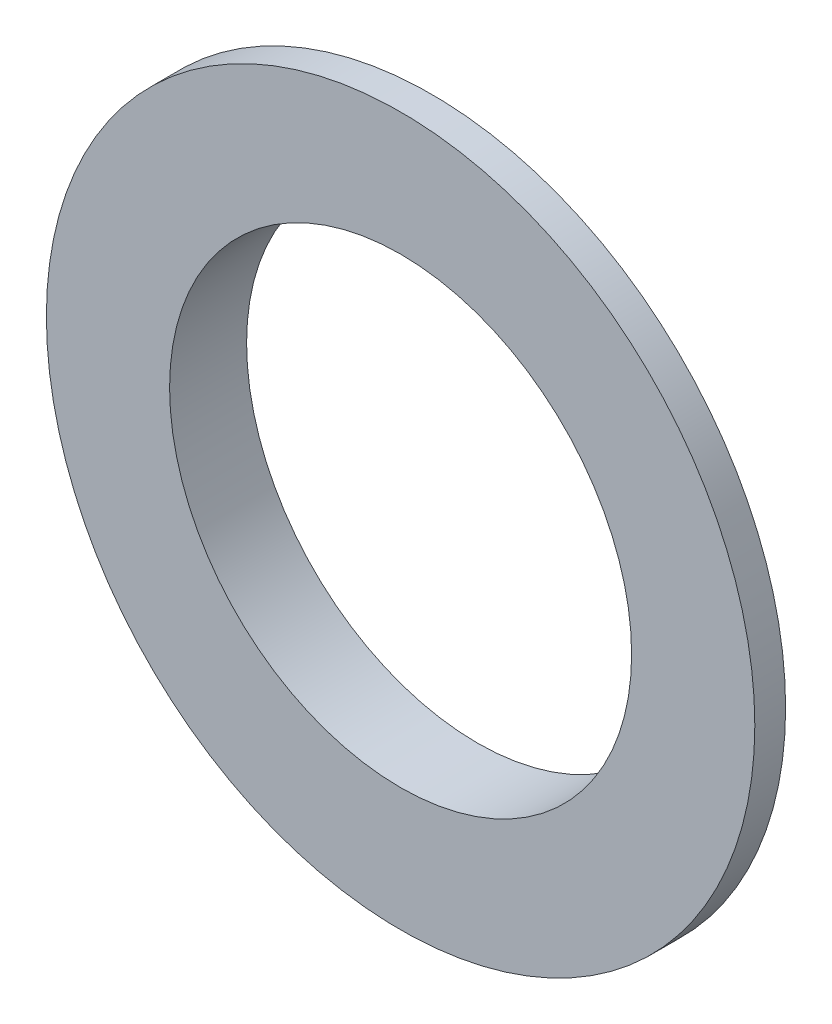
ISO-10303-21;
HEADER;
FILE_DESCRIPTION(('STEP AP214'),'2;1');
FILE_NAME('part.step','',(''),(''),'','','');
FILE_SCHEMA(('AUTOMOTIVE_DESIGN { 1 0 10303 214 1 1 1 1 }'));
ENDSEC;
DATA;
#1=APPLICATION_CONTEXT('core data for automotive mechanical design processes');
#2=APPLICATION_PROTOCOL_DEFINITION('international standard','automotive_design',2000,#1);
#3=PRODUCT_CONTEXT('',#1,'mechanical');
#4=PRODUCT('Part','Part','',(#3));
#5=PRODUCT_RELATED_PRODUCT_CATEGORY('part','',(#4));
#6=PRODUCT_DEFINITION_FORMATION('','',#4);
#7=PRODUCT_DEFINITION_CONTEXT('part definition',#1,'design');
#8=PRODUCT_DEFINITION('design','',#6,#7);
#9=PRODUCT_DEFINITION_SHAPE('','',#8);
#10=(LENGTH_UNIT() NAMED_UNIT(*) SI_UNIT(.MILLI.,.METRE.));
#11=(NAMED_UNIT(*) PLANE_ANGLE_UNIT() SI_UNIT($,.RADIAN.));
#12=(NAMED_UNIT(*) SI_UNIT($,.STERADIAN.) SOLID_ANGLE_UNIT());
#13=UNCERTAINTY_MEASURE_WITH_UNIT(LENGTH_MEASURE(1.E-05),#10,'distance_accuracy_value','');
#14=(GEOMETRIC_REPRESENTATION_CONTEXT(3) GLOBAL_UNCERTAINTY_ASSIGNED_CONTEXT((#13)) GLOBAL_UNIT_ASSIGNED_CONTEXT((#10,
#11,#12)) REPRESENTATION_CONTEXT('',''));
#15=CARTESIAN_POINT('',(0.,0.,0.));
#16=DIRECTION('',(0.,0.,1.));
#17=DIRECTION('',(1.,0.,0.));
#18=AXIS2_PLACEMENT_3D('',#15,#16,#17);
#19=CARTESIAN_POINT('',(0.,0.,0.));
#20=DIRECTION('',(0.,0.,-1.));
#21=DIRECTION('',(-1.,0.,0.));
#22=AXIS2_PLACEMENT_3D('',#19,#20,#21);
#23=PLANE('',#22);
#24=CARTESIAN_POINT('',(0.,0.,0.));
#25=DIRECTION('',(0.,0.,1.));
#26=DIRECTION('',(1.,0.,0.));
#27=AXIS2_PLACEMENT_3D('',#24,#25,#26);
#28=CIRCLE('',#27,7.5);
#29=CARTESIAN_POINT('',(7.5,0.,0.));
#30=VERTEX_POINT('',#29);
#31=EDGE_CURVE('E49',#30,#30,#28,.T.);
#32=ORIENTED_EDGE('',*,*,#31,.T.);
#33=EDGE_LOOP('',(#32));
#34=FACE_BOUND('',#33,.T.);
#35=CARTESIAN_POINT('',(0.,0.,0.));
#36=DIRECTION('',(0.,0.,-1.));
#37=DIRECTION('',(-1.,0.,0.));
#38=AXIS2_PLACEMENT_3D('',#35,#36,#37);
#39=CIRCLE('',#38,8.5);
#40=CARTESIAN_POINT('',(-8.5,0.,0.));
#41=VERTEX_POINT('',#40);
#42=EDGE_CURVE('E10',#41,#41,#39,.T.);
#43=ORIENTED_EDGE('',*,*,#42,.T.);
#44=EDGE_LOOP('',(#43));
#45=FACE_BOUND('',#44,.T.);
#46=ADVANCED_FACE('F30',(#34,#45),#23,.T.);
#47=CARTESIAN_POINT('',(0.,0.,0.));
#48=DIRECTION('',(0.,0.,-1.));
#49=DIRECTION('',(-1.,0.,0.));
#50=AXIS2_PLACEMENT_3D('',#47,#48,#49);
#51=CYLINDRICAL_SURFACE('',#50,8.5);
#52=CARTESIAN_POINT('',(0.,0.,1.5));
#53=DIRECTION('',(0.,0.,-1.));
#54=DIRECTION('',(-1.,0.,0.));
#55=AXIS2_PLACEMENT_3D('',#52,#53,#54);
#56=CIRCLE('',#55,8.5);
#57=CARTESIAN_POINT('',(-8.5,0.,1.5));
#58=VERTEX_POINT('',#57);
#59=EDGE_CURVE('E36',#58,#58,#56,.T.);
#60=ORIENTED_EDGE('',*,*,#59,.T.);
#61=EDGE_LOOP('',(#60));
#62=FACE_BOUND('',#61,.T.);
#63=ORIENTED_EDGE('',*,*,#42,.F.);
#64=EDGE_LOOP('',(#63));
#65=FACE_BOUND('',#64,.T.);
#66=ADVANCED_FACE('F78',(#62,#65),#51,.T.);
#67=CARTESIAN_POINT('',(0.,8.5,1.5));
#68=DIRECTION('',(0.,0.,-1.));
#69=DIRECTION('',(-1.,0.,0.));
#70=AXIS2_PLACEMENT_3D('',#67,#68,#69);
#71=PLANE('',#70);
#72=CARTESIAN_POINT('',(0.,0.,1.5));
#73=DIRECTION('',(0.,0.,-1.));
#74=DIRECTION('',(-1.,0.,0.));
#75=AXIS2_PLACEMENT_3D('',#72,#73,#74);
#76=CIRCLE('',#75,11.5);
#77=CARTESIAN_POINT('',(-11.5,0.,1.5));
#78=VERTEX_POINT('',#77);
#79=EDGE_CURVE('E40',#78,#78,#76,.T.);
#80=ORIENTED_EDGE('',*,*,#79,.T.);
#81=EDGE_LOOP('',(#80));
#82=FACE_BOUND('',#81,.T.);
#83=ORIENTED_EDGE('',*,*,#59,.F.);
#84=EDGE_LOOP('',(#83));
#85=FACE_BOUND('',#84,.T.);
#86=ADVANCED_FACE('F72',(#82,#85),#71,.T.);
#87=CARTESIAN_POINT('',(0.,0.,0.));
#88=DIRECTION('',(0.,0.,-1.));
#89=DIRECTION('',(-1.,0.,0.));
#90=AXIS2_PLACEMENT_3D('',#87,#88,#89);
#91=CYLINDRICAL_SURFACE('',#90,11.5);
#92=CARTESIAN_POINT('',(0.,0.,2.5));
#93=DIRECTION('',(0.,0.,-1.));
#94=DIRECTION('',(-1.,0.,0.));
#95=AXIS2_PLACEMENT_3D('',#92,#93,#94);
#96=CIRCLE('',#95,11.5);
#97=CARTESIAN_POINT('',(-11.5,0.,2.5));
#98=VERTEX_POINT('',#97);
#99=EDGE_CURVE('E44',#98,#98,#96,.T.);
#100=ORIENTED_EDGE('',*,*,#99,.T.);
#101=EDGE_LOOP('',(#100));
#102=FACE_BOUND('',#101,.T.);
#103=ORIENTED_EDGE('',*,*,#79,.F.);
#104=EDGE_LOOP('',(#103));
#105=FACE_BOUND('',#104,.T.);
#106=ADVANCED_FACE('F66',(#102,#105),#91,.T.);
#107=CARTESIAN_POINT('',(0.,11.5,2.5));
#108=DIRECTION('',(0.,0.,1.));
#109=DIRECTION('',(1.,0.,0.));
#110=AXIS2_PLACEMENT_3D('',#107,#108,#109);
#111=PLANE('',#110);
#112=CARTESIAN_POINT('',(0.,0.,2.5));
#113=DIRECTION('',(0.,0.,1.));
#114=DIRECTION('',(1.,0.,0.));
#115=AXIS2_PLACEMENT_3D('',#112,#113,#114);
#116=CIRCLE('',#115,7.5);
#117=CARTESIAN_POINT('',(7.5,0.,2.5));
#118=VERTEX_POINT('',#117);
#119=EDGE_CURVE('E50',#118,#118,#116,.T.);
#120=ORIENTED_EDGE('',*,*,#119,.F.);
#121=EDGE_LOOP('',(#120));
#122=FACE_BOUND('',#121,.T.);
#123=ORIENTED_EDGE('',*,*,#99,.F.);
#124=EDGE_LOOP('',(#123));
#125=FACE_BOUND('',#124,.T.);
#126=ADVANCED_FACE('F60',(#122,#125),#111,.T.);
#127=CARTESIAN_POINT('',(0.,0.,0.));
#128=DIRECTION('',(0.,0.,1.));
#129=DIRECTION('',(1.,0.,0.));
#130=AXIS2_PLACEMENT_3D('',#127,#128,#129);
#131=CYLINDRICAL_SURFACE('',#130,7.5);
#132=ORIENTED_EDGE('',*,*,#31,.F.);
#133=EDGE_LOOP('',(#132));
#134=FACE_BOUND('',#133,.T.);
#135=ORIENTED_EDGE('',*,*,#119,.T.);
#136=EDGE_LOOP('',(#135));
#137=FACE_BOUND('',#136,.T.);
#138=ADVANCED_FACE('F57',(#134,#137),#131,.F.);
#139=CLOSED_SHELL('',(#46,#66,#86,#106,#126,#138));
#140=MANIFOLD_SOLID_BREP('B2',#139);
#141=ADVANCED_BREP_SHAPE_REPRESENTATION('',(#18,#140),#14);
#142=SHAPE_DEFINITION_REPRESENTATION(#9,#141);
ENDSEC;
END-ISO-10303-21;
